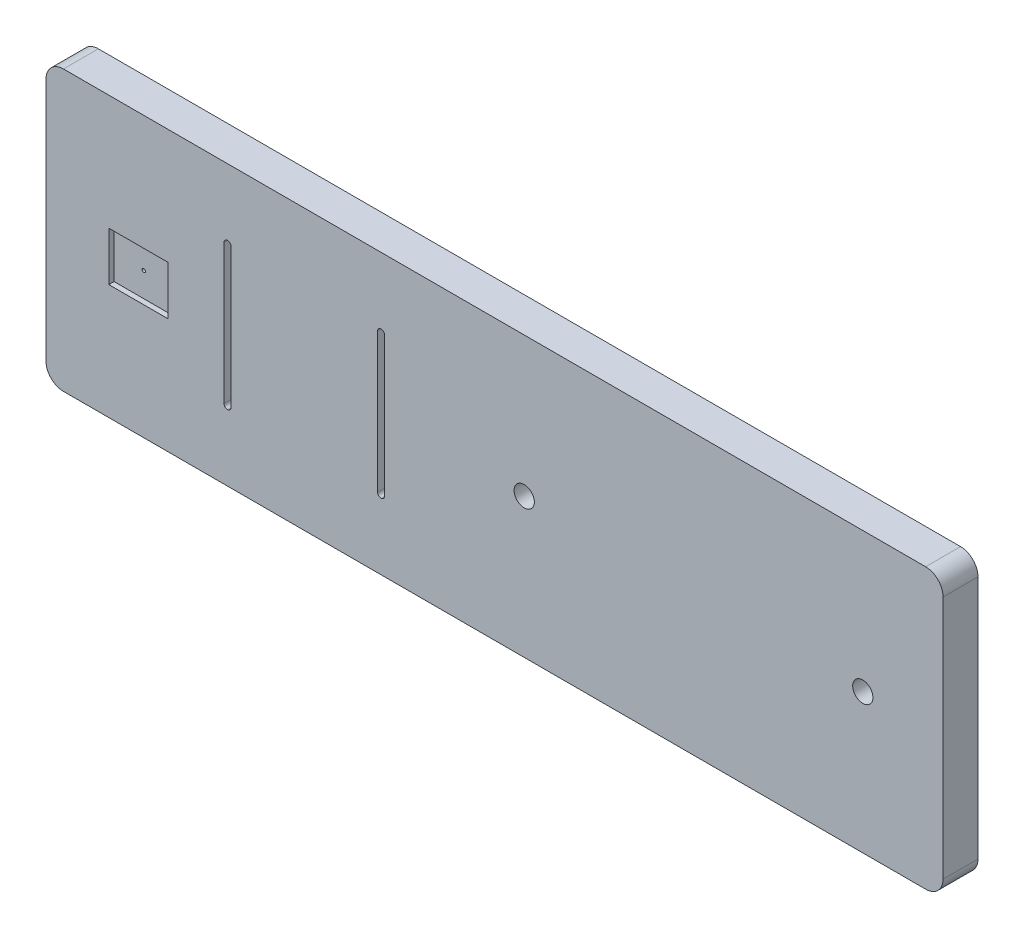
ISO-10303-21;
HEADER;
FILE_DESCRIPTION(('STEP AP214'),'2;1');
FILE_NAME('part.step','',(''),(''),'','','');
FILE_SCHEMA(('AUTOMOTIVE_DESIGN { 1 0 10303 214 1 1 1 1 }'));
ENDSEC;
DATA;
#1=APPLICATION_CONTEXT('core data for automotive mechanical design processes');
#2=APPLICATION_PROTOCOL_DEFINITION('international standard','automotive_design',2000,#1);
#3=PRODUCT_CONTEXT('',#1,'mechanical');
#4=PRODUCT('Part','Part','',(#3));
#5=PRODUCT_RELATED_PRODUCT_CATEGORY('part','',(#4));
#6=PRODUCT_DEFINITION_FORMATION('','',#4);
#7=PRODUCT_DEFINITION_CONTEXT('part definition',#1,'design');
#8=PRODUCT_DEFINITION('design','',#6,#7);
#9=PRODUCT_DEFINITION_SHAPE('','',#8);
#10=(LENGTH_UNIT() NAMED_UNIT(*) SI_UNIT(.MILLI.,.METRE.));
#11=(NAMED_UNIT(*) PLANE_ANGLE_UNIT() SI_UNIT($,.RADIAN.));
#12=(NAMED_UNIT(*) SI_UNIT($,.STERADIAN.) SOLID_ANGLE_UNIT());
#13=UNCERTAINTY_MEASURE_WITH_UNIT(LENGTH_MEASURE(1.E-05),#10,'distance_accuracy_value','');
#14=(GEOMETRIC_REPRESENTATION_CONTEXT(3) GLOBAL_UNCERTAINTY_ASSIGNED_CONTEXT((#13)) GLOBAL_UNIT_ASSIGNED_CONTEXT((#10,
#11,#12)) REPRESENTATION_CONTEXT('',''));
#15=CARTESIAN_POINT('',(0.,0.,0.));
#16=DIRECTION('',(0.,0.,1.));
#17=DIRECTION('',(1.,0.,0.));
#18=AXIS2_PLACEMENT_3D('',#15,#16,#17);
#19=CARTESIAN_POINT('',(-132.,35.,10.));
#20=DIRECTION('',(0.,0.,1.));
#21=DIRECTION('',(1.,0.,0.));
#22=AXIS2_PLACEMENT_3D('',#19,#20,#21);
#23=PLANE('',#22);
#24=DIRECTION('',(0.,-1.,0.));
#25=VECTOR('',#24,1.);
#26=CARTESIAN_POINT('',(-119.,7.,10.));
#27=LINE('',#26,#25);
#28=CARTESIAN_POINT('',(-119.,7.,10.));
#29=VERTEX_POINT('',#28);
#30=CARTESIAN_POINT('',(-119.,-7.,10.));
#31=VERTEX_POINT('',#30);
#32=EDGE_CURVE('E41',#29,#31,#27,.T.);
#33=ORIENTED_EDGE('',*,*,#32,.F.);
#34=DIRECTION('',(-1.,0.,0.));
#35=VECTOR('',#34,1.);
#36=CARTESIAN_POINT('',(-119.,7.,10.));
#37=LINE('',#36,#35);
#38=CARTESIAN_POINT('',(-102.,7.,10.));
#39=VERTEX_POINT('',#38);
#40=EDGE_CURVE('E232',#39,#29,#37,.T.);
#41=ORIENTED_EDGE('',*,*,#40,.F.);
#42=DIRECTION('',(0.,1.,0.));
#43=VECTOR('',#42,1.);
#44=CARTESIAN_POINT('',(-102.,7.,10.));
#45=LINE('',#44,#43);
#46=CARTESIAN_POINT('',(-102.,-7.,10.));
#47=VERTEX_POINT('',#46);
#48=EDGE_CURVE('E215',#47,#39,#45,.T.);
#49=ORIENTED_EDGE('',*,*,#48,.F.);
#50=DIRECTION('',(1.,0.,0.));
#51=VECTOR('',#50,1.);
#52=CARTESIAN_POINT('',(-119.,-7.,10.));
#53=LINE('',#52,#51);
#54=EDGE_CURVE('E226',#31,#47,#53,.T.);
#55=ORIENTED_EDGE('',*,*,#54,.F.);
#56=EDGE_LOOP('',(#33,#41,#49,#55));
#57=FACE_BOUND('',#56,.T.);
#58=CARTESIAN_POINT('',(-41.01,20.,10.));
#59=DIRECTION('',(0.,0.,1.));
#60=DIRECTION('',(1.,0.,0.));
#61=AXIS2_PLACEMENT_3D('',#58,#59,#60);
#62=CIRCLE('',#61,0.989999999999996);
#63=CARTESIAN_POINT('',(-41.01,20.99,10.));
#64=VERTEX_POINT('',#63);
#65=CARTESIAN_POINT('',(-42.,20.,10.));
#66=VERTEX_POINT('',#65);
#67=EDGE_CURVE('E49',#64,#66,#62,.T.);
#68=ORIENTED_EDGE('',*,*,#67,.F.);
#69=DIRECTION('',(-1.,0.,0.));
#70=VECTOR('',#69,1.);
#71=CARTESIAN_POINT('',(-41.01,20.99,10.));
#72=LINE('',#71,#70);
#73=CARTESIAN_POINT('',(-40.99,20.99,10.));
#74=VERTEX_POINT('',#73);
#75=EDGE_CURVE('E269',#74,#64,#72,.T.);
#76=ORIENTED_EDGE('',*,*,#75,.F.);
#77=CARTESIAN_POINT('',(-40.99,20.,10.));
#78=DIRECTION('',(0.,0.,1.));
#79=DIRECTION('',(-1.,0.,0.));
#80=AXIS2_PLACEMENT_3D('',#77,#78,#79);
#81=CIRCLE('',#80,0.99);
#82=CARTESIAN_POINT('',(-40.,20.,10.));
#83=VERTEX_POINT('',#82);
#84=EDGE_CURVE('E266',#83,#74,#81,.T.);
#85=ORIENTED_EDGE('',*,*,#84,.F.);
#86=DIRECTION('',(0.,1.,0.));
#87=VECTOR('',#86,1.);
#88=CARTESIAN_POINT('',(-40.,20.,10.));
#89=LINE('',#88,#87);
#90=CARTESIAN_POINT('',(-40.,-20.,10.));
#91=VERTEX_POINT('',#90);
#92=EDGE_CURVE('E263',#91,#83,#89,.T.);
#93=ORIENTED_EDGE('',*,*,#92,.F.);
#94=CARTESIAN_POINT('',(-40.99,-20.,10.));
#95=DIRECTION('',(0.,0.,1.));
#96=DIRECTION('',(1.,0.,0.));
#97=AXIS2_PLACEMENT_3D('',#94,#95,#96);
#98=CIRCLE('',#97,0.99);
#99=CARTESIAN_POINT('',(-40.99,-20.99,10.));
#100=VERTEX_POINT('',#99);
#101=EDGE_CURVE('E260',#100,#91,#98,.T.);
#102=ORIENTED_EDGE('',*,*,#101,.F.);
#103=DIRECTION('',(1.,1.73472347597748E-13,0.));
#104=VECTOR('',#103,1.);
#105=CARTESIAN_POINT('',(-41.01,-20.99,10.));
#106=LINE('',#105,#104);
#107=CARTESIAN_POINT('',(-41.01,-20.99,10.));
#108=VERTEX_POINT('',#107);
#109=EDGE_CURVE('E257',#108,#100,#106,.T.);
#110=ORIENTED_EDGE('',*,*,#109,.F.);
#111=CARTESIAN_POINT('',(-41.01,-20.,10.));
#112=DIRECTION('',(0.,0.,1.));
#113=DIRECTION('',(1.,0.,0.));
#114=AXIS2_PLACEMENT_3D('',#111,#112,#113);
#115=CIRCLE('',#114,0.989999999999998);
#116=CARTESIAN_POINT('',(-42.,-20.,10.));
#117=VERTEX_POINT('',#116);
#118=EDGE_CURVE('E254',#117,#108,#115,.T.);
#119=ORIENTED_EDGE('',*,*,#118,.F.);
#120=DIRECTION('',(0.,-1.,0.));
#121=VECTOR('',#120,1.);
#122=CARTESIAN_POINT('',(-42.,20.,10.));
#123=LINE('',#122,#121);
#124=EDGE_CURVE('E251',#66,#117,#123,.T.);
#125=ORIENTED_EDGE('',*,*,#124,.F.);
#126=EDGE_LOOP('',(#68,#76,#85,#93,#102,#110,#119,#125));
#127=FACE_BOUND('',#126,.T.);
#128=CARTESIAN_POINT('',(-85.01,20.,10.));
#129=DIRECTION('',(0.,0.,1.));
#130=DIRECTION('',(1.,0.,0.));
#131=AXIS2_PLACEMENT_3D('',#128,#129,#130);
#132=CIRCLE('',#131,0.990000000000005);
#133=CARTESIAN_POINT('',(-85.01,20.99,10.));
#134=VERTEX_POINT('',#133);
#135=CARTESIAN_POINT('',(-86.,20.,10.));
#136=VERTEX_POINT('',#135);
#137=EDGE_CURVE('E299',#134,#136,#132,.T.);
#138=ORIENTED_EDGE('',*,*,#137,.F.);
#139=DIRECTION('',(-1.,-1.73472347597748E-13,0.));
#140=VECTOR('',#139,1.);
#141=CARTESIAN_POINT('',(-85.01,20.99,10.));
#142=LINE('',#141,#140);
#143=CARTESIAN_POINT('',(-84.99,20.99,10.));
#144=VERTEX_POINT('',#143);
#145=EDGE_CURVE('E332',#144,#134,#142,.T.);
#146=ORIENTED_EDGE('',*,*,#145,.F.);
#147=CARTESIAN_POINT('',(-84.99,20.,10.));
#148=DIRECTION('',(0.,0.,1.));
#149=DIRECTION('',(-1.,0.,0.));
#150=AXIS2_PLACEMENT_3D('',#147,#148,#149);
#151=CIRCLE('',#150,0.990000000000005);
#152=CARTESIAN_POINT('',(-84.,20.,10.));
#153=VERTEX_POINT('',#152);
#154=EDGE_CURVE('E329',#153,#144,#151,.T.);
#155=ORIENTED_EDGE('',*,*,#154,.F.);
#156=DIRECTION('',(0.,1.,0.));
#157=VECTOR('',#156,1.);
#158=CARTESIAN_POINT('',(-84.,20.,10.));
#159=LINE('',#158,#157);
#160=CARTESIAN_POINT('',(-84.,-20.,10.));
#161=VERTEX_POINT('',#160);
#162=EDGE_CURVE('E326',#161,#153,#159,.T.);
#163=ORIENTED_EDGE('',*,*,#162,.F.);
#164=CARTESIAN_POINT('',(-84.99,-20.,10.));
#165=DIRECTION('',(0.,0.,1.));
#166=DIRECTION('',(1.,0.,0.));
#167=AXIS2_PLACEMENT_3D('',#164,#165,#166);
#168=CIRCLE('',#167,0.990000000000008);
#169=CARTESIAN_POINT('',(-84.99,-20.99,10.));
#170=VERTEX_POINT('',#169);
#171=EDGE_CURVE('E323',#170,#161,#168,.T.);
#172=ORIENTED_EDGE('',*,*,#171,.F.);
#173=DIRECTION('',(1.,1.73472347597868E-13,0.));
#174=VECTOR('',#173,1.);
#175=CARTESIAN_POINT('',(-85.01,-20.99,10.));
#176=LINE('',#175,#174);
#177=CARTESIAN_POINT('',(-85.01,-20.99,10.));
#178=VERTEX_POINT('',#177);
#179=EDGE_CURVE('E320',#178,#170,#176,.T.);
#180=ORIENTED_EDGE('',*,*,#179,.F.);
#181=CARTESIAN_POINT('',(-85.01,-20.,10.));
#182=DIRECTION('',(0.,0.,1.));
#183=DIRECTION('',(1.,0.,0.));
#184=AXIS2_PLACEMENT_3D('',#181,#182,#183);
#185=CIRCLE('',#184,0.990000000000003);
#186=CARTESIAN_POINT('',(-86.,-20.,10.));
#187=VERTEX_POINT('',#186);
#188=EDGE_CURVE('E317',#187,#178,#185,.T.);
#189=ORIENTED_EDGE('',*,*,#188,.F.);
#190=DIRECTION('',(0.,-1.,0.));
#191=VECTOR('',#190,1.);
#192=CARTESIAN_POINT('',(-86.,20.,10.));
#193=LINE('',#192,#191);
#194=EDGE_CURVE('E314',#136,#187,#193,.T.);
#195=ORIENTED_EDGE('',*,*,#194,.F.);
#196=EDGE_LOOP('',(#138,#146,#155,#163,#172,#180,#189,#195));
#197=FACE_BOUND('',#196,.T.);
#198=CARTESIAN_POINT('',(97.,0.,10.));
#199=DIRECTION('',(0.,0.,1.));
#200=DIRECTION('',(1.,0.,0.));
#201=AXIS2_PLACEMENT_3D('',#198,#199,#200);
#202=CIRCLE('',#201,2.9);
#203=CARTESIAN_POINT('',(99.9,0.,10.));
#204=VERTEX_POINT('',#203);
#205=EDGE_CURVE('E385',#204,#204,#202,.T.);
#206=ORIENTED_EDGE('',*,*,#205,.F.);
#207=EDGE_LOOP('',(#206));
#208=FACE_BOUND('',#207,.T.);
#209=CARTESIAN_POINT('',(-132.,35.,10.));
#210=DIRECTION('',(0.,0.,1.));
#211=DIRECTION('',(1.,0.,0.));
#212=AXIS2_PLACEMENT_3D('',#209,#210,#211);
#213=CIRCLE('',#212,5.);
#214=CARTESIAN_POINT('',(-132.,40.,10.));
#215=VERTEX_POINT('',#214);
#216=CARTESIAN_POINT('',(-137.,35.,10.));
#217=VERTEX_POINT('',#216);
#218=EDGE_CURVE('E405',#215,#217,#213,.T.);
#219=ORIENTED_EDGE('',*,*,#218,.T.);
#220=DIRECTION('',(0.,-1.,0.));
#221=VECTOR('',#220,1.);
#222=CARTESIAN_POINT('',(-137.,35.,10.));
#223=LINE('',#222,#221);
#224=CARTESIAN_POINT('',(-137.,-35.,10.));
#225=VERTEX_POINT('',#224);
#226=EDGE_CURVE('E408',#217,#225,#223,.T.);
#227=ORIENTED_EDGE('',*,*,#226,.T.);
#228=CARTESIAN_POINT('',(-132.,-35.,10.));
#229=DIRECTION('',(0.,0.,1.));
#230=DIRECTION('',(-1.,0.,0.));
#231=AXIS2_PLACEMENT_3D('',#228,#229,#230);
#232=CIRCLE('',#231,5.);
#233=CARTESIAN_POINT('',(-132.,-40.,10.));
#234=VERTEX_POINT('',#233);
#235=EDGE_CURVE('E410',#225,#234,#232,.T.);
#236=ORIENTED_EDGE('',*,*,#235,.T.);
#237=DIRECTION('',(1.,0.,0.));
#238=VECTOR('',#237,1.);
#239=CARTESIAN_POINT('',(115.,-40.,10.));
#240=LINE('',#239,#238);
#241=CARTESIAN_POINT('',(115.,-40.,10.));
#242=VERTEX_POINT('',#241);
#243=EDGE_CURVE('E412',#234,#242,#240,.T.);
#244=ORIENTED_EDGE('',*,*,#243,.T.);
#245=CARTESIAN_POINT('',(115.,-35.,10.));
#246=DIRECTION('',(0.,0.,1.));
#247=DIRECTION('',(-1.,0.,0.));
#248=AXIS2_PLACEMENT_3D('',#245,#246,#247);
#249=CIRCLE('',#248,5.00000000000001);
#250=CARTESIAN_POINT('',(120.,-35.,10.));
#251=VERTEX_POINT('',#250);
#252=EDGE_CURVE('E414',#242,#251,#249,.T.);
#253=ORIENTED_EDGE('',*,*,#252,.T.);
#254=DIRECTION('',(0.,1.,0.));
#255=VECTOR('',#254,1.);
#256=CARTESIAN_POINT('',(120.,35.,10.));
#257=LINE('',#256,#255);
#258=CARTESIAN_POINT('',(120.,35.,10.));
#259=VERTEX_POINT('',#258);
#260=EDGE_CURVE('E416',#251,#259,#257,.T.);
#261=ORIENTED_EDGE('',*,*,#260,.T.);
#262=CARTESIAN_POINT('',(115.,35.,10.));
#263=DIRECTION('',(0.,0.,1.));
#264=DIRECTION('',(-1.,0.,0.));
#265=AXIS2_PLACEMENT_3D('',#262,#263,#264);
#266=CIRCLE('',#265,5.);
#267=CARTESIAN_POINT('',(115.,40.,10.));
#268=VERTEX_POINT('',#267);
#269=EDGE_CURVE('E418',#259,#268,#266,.T.);
#270=ORIENTED_EDGE('',*,*,#269,.T.);
#271=DIRECTION('',(-1.,0.,0.));
#272=VECTOR('',#271,1.);
#273=CARTESIAN_POINT('',(115.,40.,10.));
#274=LINE('',#273,#272);
#275=EDGE_CURVE('E420',#268,#215,#274,.T.);
#276=ORIENTED_EDGE('',*,*,#275,.T.);
#277=EDGE_LOOP('',(#219,#227,#236,#244,#253,#261,#270,#276));
#278=FACE_BOUND('',#277,.T.);
#279=CARTESIAN_POINT('',(0.,0.,10.));
#280=DIRECTION('',(0.,0.,1.));
#281=DIRECTION('',(1.,0.,0.));
#282=AXIS2_PLACEMENT_3D('',#279,#280,#281);
#283=CIRCLE('',#282,2.9);
#284=CARTESIAN_POINT('',(2.9,0.,10.));
#285=VERTEX_POINT('',#284);
#286=EDGE_CURVE('E379',#285,#285,#283,.T.);
#287=ORIENTED_EDGE('',*,*,#286,.F.);
#288=EDGE_LOOP('',(#287));
#289=FACE_BOUND('',#288,.T.);
#290=ADVANCED_FACE('F26',(#57,#127,#197,#208,#278,#289),#23,.T.);
#291=CARTESIAN_POINT('',(-132.,35.,0.));
#292=DIRECTION('',(0.,0.,1.));
#293=DIRECTION('',(1.,0.,0.));
#294=AXIS2_PLACEMENT_3D('',#291,#292,#293);
#295=PLANE('',#294);
#296=CARTESIAN_POINT('',(97.,0.,0.));
#297=DIRECTION('',(0.,0.,1.));
#298=DIRECTION('',(1.,0.,0.));
#299=AXIS2_PLACEMENT_3D('',#296,#297,#298);
#300=CIRCLE('',#299,2.9);
#301=CARTESIAN_POINT('',(99.9,0.,0.));
#302=VERTEX_POINT('',#301);
#303=EDGE_CURVE('E382',#302,#302,#300,.T.);
#304=ORIENTED_EDGE('',*,*,#303,.T.);
#305=EDGE_LOOP('',(#304));
#306=FACE_BOUND('',#305,.T.);
#307=CARTESIAN_POINT('',(-132.,35.,0.));
#308=DIRECTION('',(0.,0.,1.));
#309=DIRECTION('',(1.,0.,0.));
#310=AXIS2_PLACEMENT_3D('',#307,#308,#309);
#311=CIRCLE('',#310,5.);
#312=CARTESIAN_POINT('',(-132.,40.,0.));
#313=VERTEX_POINT('',#312);
#314=CARTESIAN_POINT('',(-137.,35.,0.));
#315=VERTEX_POINT('',#314);
#316=EDGE_CURVE('E388',#313,#315,#311,.T.);
#317=ORIENTED_EDGE('',*,*,#316,.F.);
#318=DIRECTION('',(-1.,0.,0.));
#319=VECTOR('',#318,1.);
#320=CARTESIAN_POINT('',(115.,40.,0.));
#321=LINE('',#320,#319);
#322=CARTESIAN_POINT('',(115.,40.,0.));
#323=VERTEX_POINT('',#322);
#324=EDGE_CURVE('E403',#323,#313,#321,.T.);
#325=ORIENTED_EDGE('',*,*,#324,.F.);
#326=CARTESIAN_POINT('',(115.,35.,0.));
#327=DIRECTION('',(0.,0.,1.));
#328=DIRECTION('',(-1.,0.,0.));
#329=AXIS2_PLACEMENT_3D('',#326,#327,#328);
#330=CIRCLE('',#329,5.);
#331=CARTESIAN_POINT('',(120.,35.,0.));
#332=VERTEX_POINT('',#331);
#333=EDGE_CURVE('E401',#332,#323,#330,.T.);
#334=ORIENTED_EDGE('',*,*,#333,.F.);
#335=DIRECTION('',(0.,1.,0.));
#336=VECTOR('',#335,1.);
#337=CARTESIAN_POINT('',(120.,35.,0.));
#338=LINE('',#337,#336);
#339=CARTESIAN_POINT('',(120.,-35.,0.));
#340=VERTEX_POINT('',#339);
#341=EDGE_CURVE('E399',#340,#332,#338,.T.);
#342=ORIENTED_EDGE('',*,*,#341,.F.);
#343=CARTESIAN_POINT('',(115.,-35.,0.));
#344=DIRECTION('',(0.,0.,1.));
#345=DIRECTION('',(-1.,0.,0.));
#346=AXIS2_PLACEMENT_3D('',#343,#344,#345);
#347=CIRCLE('',#346,5.00000000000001);
#348=CARTESIAN_POINT('',(115.,-40.,0.));
#349=VERTEX_POINT('',#348);
#350=EDGE_CURVE('E397',#349,#340,#347,.T.);
#351=ORIENTED_EDGE('',*,*,#350,.F.);
#352=DIRECTION('',(1.,0.,0.));
#353=VECTOR('',#352,1.);
#354=CARTESIAN_POINT('',(115.,-40.,0.));
#355=LINE('',#354,#353);
#356=CARTESIAN_POINT('',(-132.,-40.,0.));
#357=VERTEX_POINT('',#356);
#358=EDGE_CURVE('E395',#357,#349,#355,.T.);
#359=ORIENTED_EDGE('',*,*,#358,.F.);
#360=CARTESIAN_POINT('',(-132.,-35.,0.));
#361=DIRECTION('',(0.,0.,1.));
#362=DIRECTION('',(-1.,0.,0.));
#363=AXIS2_PLACEMENT_3D('',#360,#361,#362);
#364=CIRCLE('',#363,5.);
#365=CARTESIAN_POINT('',(-137.,-35.,0.));
#366=VERTEX_POINT('',#365);
#367=EDGE_CURVE('E393',#366,#357,#364,.T.);
#368=ORIENTED_EDGE('',*,*,#367,.F.);
#369=DIRECTION('',(0.,-1.,0.));
#370=VECTOR('',#369,1.);
#371=CARTESIAN_POINT('',(-137.,35.,0.));
#372=LINE('',#371,#370);
#373=EDGE_CURVE('E391',#315,#366,#372,.T.);
#374=ORIENTED_EDGE('',*,*,#373,.F.);
#375=EDGE_LOOP('',(#317,#325,#334,#342,#351,#359,#368,#374));
#376=FACE_BOUND('',#375,.T.);
#377=CARTESIAN_POINT('',(0.,0.,0.));
#378=DIRECTION('',(0.,0.,1.));
#379=DIRECTION('',(1.,0.,0.));
#380=AXIS2_PLACEMENT_3D('',#377,#378,#379);
#381=CIRCLE('',#380,2.9);
#382=CARTESIAN_POINT('',(2.9,0.,0.));
#383=VERTEX_POINT('',#382);
#384=EDGE_CURVE('E362',#383,#383,#381,.T.);
#385=ORIENTED_EDGE('',*,*,#384,.T.);
#386=EDGE_LOOP('',(#385));
#387=FACE_BOUND('',#386,.T.);
#388=ADVANCED_FACE('F450',(#306,#376,#387),#295,.F.);
#389=CARTESIAN_POINT('',(-132.,35.,10.));
#390=DIRECTION('',(0.,0.,-1.));
#391=DIRECTION('',(-1.,0.,0.));
#392=AXIS2_PLACEMENT_3D('',#389,#390,#391);
#393=CYLINDRICAL_SURFACE('',#392,5.);
#394=ORIENTED_EDGE('',*,*,#316,.T.);
#395=DIRECTION('',(0.,0.,-1.));
#396=VECTOR('',#395,1.);
#397=CARTESIAN_POINT('',(-137.,35.,10.));
#398=LINE('',#397,#396);
#399=EDGE_CURVE('E11',#217,#315,#398,.T.);
#400=ORIENTED_EDGE('',*,*,#399,.F.);
#401=ORIENTED_EDGE('',*,*,#218,.F.);
#402=DIRECTION('',(0.,0.,-1.));
#403=VECTOR('',#402,1.);
#404=CARTESIAN_POINT('',(-132.,40.,10.));
#405=LINE('',#404,#403);
#406=EDGE_CURVE('E422',#215,#313,#405,.T.);
#407=ORIENTED_EDGE('',*,*,#406,.T.);
#408=EDGE_LOOP('',(#394,#400,#401,#407));
#409=FACE_BOUND('',#408,.T.);
#410=ADVANCED_FACE('F28',(#409),#393,.T.);
#411=CARTESIAN_POINT('',(-137.,35.,10.));
#412=DIRECTION('',(1.,0.,0.));
#413=DIRECTION('',(0.,0.,-1.));
#414=AXIS2_PLACEMENT_3D('',#411,#412,#413);
#415=PLANE('',#414);
#416=ORIENTED_EDGE('',*,*,#373,.T.);
#417=DIRECTION('',(0.,0.,-1.));
#418=VECTOR('',#417,1.);
#419=CARTESIAN_POINT('',(-137.,-35.,10.));
#420=LINE('',#419,#418);
#421=EDGE_CURVE('E34',#225,#366,#420,.T.);
#422=ORIENTED_EDGE('',*,*,#421,.F.);
#423=ORIENTED_EDGE('',*,*,#226,.F.);
#424=ORIENTED_EDGE('',*,*,#399,.T.);
#425=EDGE_LOOP('',(#416,#422,#423,#424));
#426=FACE_BOUND('',#425,.T.);
#427=ADVANCED_FACE('F468',(#426),#415,.F.);
#428=CARTESIAN_POINT('',(-132.,-35.,10.));
#429=DIRECTION('',(0.,0.,-1.));
#430=DIRECTION('',(-1.,0.,0.));
#431=AXIS2_PLACEMENT_3D('',#428,#429,#430);
#432=CYLINDRICAL_SURFACE('',#431,5.);
#433=ORIENTED_EDGE('',*,*,#367,.T.);
#434=DIRECTION('',(0.,0.,-1.));
#435=VECTOR('',#434,1.);
#436=CARTESIAN_POINT('',(-132.,-40.,10.));
#437=LINE('',#436,#435);
#438=EDGE_CURVE('E437',#234,#357,#437,.T.);
#439=ORIENTED_EDGE('',*,*,#438,.F.);
#440=ORIENTED_EDGE('',*,*,#235,.F.);
#441=ORIENTED_EDGE('',*,*,#421,.T.);
#442=EDGE_LOOP('',(#433,#439,#440,#441));
#443=FACE_BOUND('',#442,.T.);
#444=ADVANCED_FACE('F444',(#443),#432,.T.);
#445=CARTESIAN_POINT('',(115.,-40.,10.));
#446=DIRECTION('',(0.,1.,0.));
#447=DIRECTION('',(-1.,0.,0.));
#448=AXIS2_PLACEMENT_3D('',#445,#446,#447);
#449=PLANE('',#448);
#450=ORIENTED_EDGE('',*,*,#358,.T.);
#451=DIRECTION('',(0.,0.,-1.));
#452=VECTOR('',#451,1.);
#453=CARTESIAN_POINT('',(115.,-40.,10.));
#454=LINE('',#453,#452);
#455=EDGE_CURVE('E434',#242,#349,#454,.T.);
#456=ORIENTED_EDGE('',*,*,#455,.F.);
#457=ORIENTED_EDGE('',*,*,#243,.F.);
#458=ORIENTED_EDGE('',*,*,#438,.T.);
#459=EDGE_LOOP('',(#450,#456,#457,#458));
#460=FACE_BOUND('',#459,.T.);
#461=ADVANCED_FACE('F456',(#460),#449,.F.);
#462=CARTESIAN_POINT('',(115.,-35.,10.));
#463=DIRECTION('',(0.,0.,-1.));
#464=DIRECTION('',(-1.,0.,0.));
#465=AXIS2_PLACEMENT_3D('',#462,#463,#464);
#466=CYLINDRICAL_SURFACE('',#465,5.00000000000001);
#467=ORIENTED_EDGE('',*,*,#350,.T.);
#468=DIRECTION('',(0.,0.,-1.));
#469=VECTOR('',#468,1.);
#470=CARTESIAN_POINT('',(120.,-35.,10.));
#471=LINE('',#470,#469);
#472=EDGE_CURVE('E431',#251,#340,#471,.T.);
#473=ORIENTED_EDGE('',*,*,#472,.F.);
#474=ORIENTED_EDGE('',*,*,#252,.F.);
#475=ORIENTED_EDGE('',*,*,#455,.T.);
#476=EDGE_LOOP('',(#467,#473,#474,#475));
#477=FACE_BOUND('',#476,.T.);
#478=ADVANCED_FACE('F460',(#477),#466,.T.);
#479=CARTESIAN_POINT('',(120.,35.,10.));
#480=DIRECTION('',(-1.,0.,0.));
#481=DIRECTION('',(0.,-1.,0.));
#482=AXIS2_PLACEMENT_3D('',#479,#480,#481);
#483=PLANE('',#482);
#484=ORIENTED_EDGE('',*,*,#341,.T.);
#485=DIRECTION('',(0.,0.,-1.));
#486=VECTOR('',#485,1.);
#487=CARTESIAN_POINT('',(120.,35.,10.));
#488=LINE('',#487,#486);
#489=EDGE_CURVE('E428',#259,#332,#488,.T.);
#490=ORIENTED_EDGE('',*,*,#489,.F.);
#491=ORIENTED_EDGE('',*,*,#260,.F.);
#492=ORIENTED_EDGE('',*,*,#472,.T.);
#493=EDGE_LOOP('',(#484,#490,#491,#492));
#494=FACE_BOUND('',#493,.T.);
#495=ADVANCED_FACE('F481',(#494),#483,.F.);
#496=CARTESIAN_POINT('',(115.,35.,10.));
#497=DIRECTION('',(0.,0.,-1.));
#498=DIRECTION('',(-1.,0.,0.));
#499=AXIS2_PLACEMENT_3D('',#496,#497,#498);
#500=CYLINDRICAL_SURFACE('',#499,5.);
#501=ORIENTED_EDGE('',*,*,#333,.T.);
#502=DIRECTION('',(0.,0.,-1.));
#503=VECTOR('',#502,1.);
#504=CARTESIAN_POINT('',(115.,40.,10.));
#505=LINE('',#504,#503);
#506=EDGE_CURVE('E425',#268,#323,#505,.T.);
#507=ORIENTED_EDGE('',*,*,#506,.F.);
#508=ORIENTED_EDGE('',*,*,#269,.F.);
#509=ORIENTED_EDGE('',*,*,#489,.T.);
#510=EDGE_LOOP('',(#501,#507,#508,#509));
#511=FACE_BOUND('',#510,.T.);
#512=ADVANCED_FACE('F479',(#511),#500,.T.);
#513=CARTESIAN_POINT('',(115.,40.,10.));
#514=DIRECTION('',(0.,-1.,0.));
#515=DIRECTION('',(1.,0.,0.));
#516=AXIS2_PLACEMENT_3D('',#513,#514,#515);
#517=PLANE('',#516);
#518=ORIENTED_EDGE('',*,*,#324,.T.);
#519=ORIENTED_EDGE('',*,*,#406,.F.);
#520=ORIENTED_EDGE('',*,*,#275,.F.);
#521=ORIENTED_EDGE('',*,*,#506,.T.);
#522=EDGE_LOOP('',(#518,#519,#520,#521));
#523=FACE_BOUND('',#522,.T.);
#524=ADVANCED_FACE('F474',(#523),#517,.F.);
#525=CARTESIAN_POINT('',(97.,0.,10.));
#526=DIRECTION('',(0.,0.,-1.));
#527=DIRECTION('',(-1.,0.,0.));
#528=AXIS2_PLACEMENT_3D('',#525,#526,#527);
#529=CYLINDRICAL_SURFACE('',#528,2.9);
#530=ORIENTED_EDGE('',*,*,#205,.T.);
#531=EDGE_LOOP('',(#530));
#532=FACE_BOUND('',#531,.T.);
#533=ORIENTED_EDGE('',*,*,#303,.F.);
#534=EDGE_LOOP('',(#533));
#535=FACE_BOUND('',#534,.T.);
#536=ADVANCED_FACE('F502',(#532,#535),#529,.F.);
#537=CARTESIAN_POINT('',(0.,0.,10.));
#538=DIRECTION('',(0.,0.,-1.));
#539=DIRECTION('',(-1.,0.,0.));
#540=AXIS2_PLACEMENT_3D('',#537,#538,#539);
#541=CYLINDRICAL_SURFACE('',#540,2.9);
#542=ORIENTED_EDGE('',*,*,#286,.T.);
#543=EDGE_LOOP('',(#542));
#544=FACE_BOUND('',#543,.T.);
#545=ORIENTED_EDGE('',*,*,#384,.F.);
#546=EDGE_LOOP('',(#545));
#547=FACE_BOUND('',#546,.T.);
#548=ADVANCED_FACE('F506',(#544,#547),#541,.F.);
#549=CARTESIAN_POINT('',(-85.01,20.,5.));
#550=DIRECTION('',(0.,0.,1.));
#551=DIRECTION('',(1.,0.,0.));
#552=AXIS2_PLACEMENT_3D('',#549,#550,#551);
#553=CYLINDRICAL_SURFACE('',#552,0.990000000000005);
#554=ORIENTED_EDGE('',*,*,#137,.T.);
#555=DIRECTION('',(0.,0.,1.));
#556=VECTOR('',#555,1.);
#557=CARTESIAN_POINT('',(-86.,20.,5.));
#558=LINE('',#557,#556);
#559=CARTESIAN_POINT('',(-86.,20.,5.));
#560=VERTEX_POINT('',#559);
#561=EDGE_CURVE('E359',#560,#136,#558,.T.);
#562=ORIENTED_EDGE('',*,*,#561,.F.);
#563=CARTESIAN_POINT('',(-85.01,20.,5.));
#564=DIRECTION('',(0.,0.,1.));
#565=DIRECTION('',(1.,0.,0.));
#566=AXIS2_PLACEMENT_3D('',#563,#564,#565);
#567=CIRCLE('',#566,0.990000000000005);
#568=CARTESIAN_POINT('',(-85.01,20.99,5.));
#569=VERTEX_POINT('',#568);
#570=EDGE_CURVE('E335',#569,#560,#567,.T.);
#571=ORIENTED_EDGE('',*,*,#570,.F.);
#572=DIRECTION('',(0.,0.,1.));
#573=VECTOR('',#572,1.);
#574=CARTESIAN_POINT('',(-85.01,20.99,5.));
#575=LINE('',#574,#573);
#576=EDGE_CURVE('E360',#569,#134,#575,.T.);
#577=ORIENTED_EDGE('',*,*,#576,.T.);
#578=EDGE_LOOP('',(#554,#562,#571,#577));
#579=FACE_BOUND('',#578,.T.);
#580=ADVANCED_FACE('F511',(#579),#553,.F.);
#581=CARTESIAN_POINT('',(-85.01,20.99,5.));
#582=DIRECTION('',(-1.73472347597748E-13,1.,0.));
#583=DIRECTION('',(-1.,-1.73472347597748E-13,0.));
#584=AXIS2_PLACEMENT_3D('',#581,#582,#583);
#585=PLANE('',#584);
#586=ORIENTED_EDGE('',*,*,#145,.T.);
#587=ORIENTED_EDGE('',*,*,#576,.F.);
#588=DIRECTION('',(-1.,-1.73472347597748E-13,0.));
#589=VECTOR('',#588,1.);
#590=CARTESIAN_POINT('',(-85.01,20.99,5.));
#591=LINE('',#590,#589);
#592=CARTESIAN_POINT('',(-84.99,20.99,5.));
#593=VERTEX_POINT('',#592);
#594=EDGE_CURVE('E356',#593,#569,#591,.T.);
#595=ORIENTED_EDGE('',*,*,#594,.F.);
#596=DIRECTION('',(0.,0.,1.));
#597=VECTOR('',#596,1.);
#598=CARTESIAN_POINT('',(-84.99,20.99,5.));
#599=LINE('',#598,#597);
#600=EDGE_CURVE('E363',#593,#144,#599,.T.);
#601=ORIENTED_EDGE('',*,*,#600,.T.);
#602=EDGE_LOOP('',(#586,#587,#595,#601));
#603=FACE_BOUND('',#602,.T.);
#604=ADVANCED_FACE('F518',(#603),#585,.F.);
#605=CARTESIAN_POINT('',(-84.99,20.,5.));
#606=DIRECTION('',(0.,0.,1.));
#607=DIRECTION('',(1.,0.,0.));
#608=AXIS2_PLACEMENT_3D('',#605,#606,#607);
#609=CYLINDRICAL_SURFACE('',#608,0.990000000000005);
#610=ORIENTED_EDGE('',*,*,#154,.T.);
#611=ORIENTED_EDGE('',*,*,#600,.F.);
#612=CARTESIAN_POINT('',(-84.99,20.,5.));
#613=DIRECTION('',(0.,0.,1.));
#614=DIRECTION('',(-1.,0.,0.));
#615=AXIS2_PLACEMENT_3D('',#612,#613,#614);
#616=CIRCLE('',#615,0.990000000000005);
#617=CARTESIAN_POINT('',(-84.,20.,5.));
#618=VERTEX_POINT('',#617);
#619=EDGE_CURVE('E353',#618,#593,#616,.T.);
#620=ORIENTED_EDGE('',*,*,#619,.F.);
#621=DIRECTION('',(0.,0.,1.));
#622=VECTOR('',#621,1.);
#623=CARTESIAN_POINT('',(-84.,20.,5.));
#624=LINE('',#623,#622);
#625=EDGE_CURVE('E365',#618,#153,#624,.T.);
#626=ORIENTED_EDGE('',*,*,#625,.T.);
#627=EDGE_LOOP('',(#610,#611,#620,#626));
#628=FACE_BOUND('',#627,.T.);
#629=ADVANCED_FACE('F540',(#628),#609,.F.);
#630=CARTESIAN_POINT('',(-84.,20.,5.));
#631=DIRECTION('',(1.,0.,0.));
#632=DIRECTION('',(0.,1.,0.));
#633=AXIS2_PLACEMENT_3D('',#630,#631,#632);
#634=PLANE('',#633);
#635=ORIENTED_EDGE('',*,*,#162,.T.);
#636=ORIENTED_EDGE('',*,*,#625,.F.);
#637=DIRECTION('',(0.,1.,0.));
#638=VECTOR('',#637,1.);
#639=CARTESIAN_POINT('',(-84.,20.,5.));
#640=LINE('',#639,#638);
#641=CARTESIAN_POINT('',(-84.,-20.,5.));
#642=VERTEX_POINT('',#641);
#643=EDGE_CURVE('E350',#642,#618,#640,.T.);
#644=ORIENTED_EDGE('',*,*,#643,.F.);
#645=DIRECTION('',(0.,0.,1.));
#646=VECTOR('',#645,1.);
#647=CARTESIAN_POINT('',(-84.,-20.,5.));
#648=LINE('',#647,#646);
#649=EDGE_CURVE('E367',#642,#161,#648,.T.);
#650=ORIENTED_EDGE('',*,*,#649,.T.);
#651=EDGE_LOOP('',(#635,#636,#644,#650));
#652=FACE_BOUND('',#651,.T.);
#653=ADVANCED_FACE('F536',(#652),#634,.F.);
#654=CARTESIAN_POINT('',(-84.99,-20.,5.));
#655=DIRECTION('',(0.,0.,1.));
#656=DIRECTION('',(1.,0.,0.));
#657=AXIS2_PLACEMENT_3D('',#654,#655,#656);
#658=CYLINDRICAL_SURFACE('',#657,0.990000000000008);
#659=ORIENTED_EDGE('',*,*,#171,.T.);
#660=ORIENTED_EDGE('',*,*,#649,.F.);
#661=CARTESIAN_POINT('',(-84.99,-20.,5.));
#662=DIRECTION('',(0.,0.,1.));
#663=DIRECTION('',(1.,0.,0.));
#664=AXIS2_PLACEMENT_3D('',#661,#662,#663);
#665=CIRCLE('',#664,0.990000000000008);
#666=CARTESIAN_POINT('',(-84.99,-20.99,5.));
#667=VERTEX_POINT('',#666);
#668=EDGE_CURVE('E347',#667,#642,#665,.T.);
#669=ORIENTED_EDGE('',*,*,#668,.F.);
#670=DIRECTION('',(0.,0.,1.));
#671=VECTOR('',#670,1.);
#672=CARTESIAN_POINT('',(-84.99,-20.99,5.));
#673=LINE('',#672,#671);
#674=EDGE_CURVE('E369',#667,#170,#673,.T.);
#675=ORIENTED_EDGE('',*,*,#674,.T.);
#676=EDGE_LOOP('',(#659,#660,#669,#675));
#677=FACE_BOUND('',#676,.T.);
#678=ADVANCED_FACE('F532',(#677),#658,.F.);
#679=CARTESIAN_POINT('',(-85.01,-20.99,5.));
#680=DIRECTION('',(1.73472347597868E-13,-1.,0.));
#681=DIRECTION('',(1.,1.73472347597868E-13,0.));
#682=AXIS2_PLACEMENT_3D('',#679,#680,#681);
#683=PLANE('',#682);
#684=ORIENTED_EDGE('',*,*,#179,.T.);
#685=ORIENTED_EDGE('',*,*,#674,.F.);
#686=DIRECTION('',(1.,1.73472347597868E-13,0.));
#687=VECTOR('',#686,1.);
#688=CARTESIAN_POINT('',(-85.01,-20.99,5.));
#689=LINE('',#688,#687);
#690=CARTESIAN_POINT('',(-85.01,-20.99,5.));
#691=VERTEX_POINT('',#690);
#692=EDGE_CURVE('E344',#691,#667,#689,.T.);
#693=ORIENTED_EDGE('',*,*,#692,.F.);
#694=DIRECTION('',(0.,0.,1.));
#695=VECTOR('',#694,1.);
#696=CARTESIAN_POINT('',(-85.01,-20.99,5.));
#697=LINE('',#696,#695);
#698=EDGE_CURVE('E371',#691,#178,#697,.T.);
#699=ORIENTED_EDGE('',*,*,#698,.T.);
#700=EDGE_LOOP('',(#684,#685,#693,#699));
#701=FACE_BOUND('',#700,.T.);
#702=ADVANCED_FACE('F528',(#701),#683,.F.);
#703=CARTESIAN_POINT('',(-85.01,-20.,5.));
#704=DIRECTION('',(0.,0.,1.));
#705=DIRECTION('',(1.,0.,0.));
#706=AXIS2_PLACEMENT_3D('',#703,#704,#705);
#707=CYLINDRICAL_SURFACE('',#706,0.990000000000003);
#708=ORIENTED_EDGE('',*,*,#188,.T.);
#709=ORIENTED_EDGE('',*,*,#698,.F.);
#710=CARTESIAN_POINT('',(-85.01,-20.,5.));
#711=DIRECTION('',(0.,0.,1.));
#712=DIRECTION('',(1.,0.,0.));
#713=AXIS2_PLACEMENT_3D('',#710,#711,#712);
#714=CIRCLE('',#713,0.990000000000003);
#715=CARTESIAN_POINT('',(-86.,-20.,5.));
#716=VERTEX_POINT('',#715);
#717=EDGE_CURVE('E341',#716,#691,#714,.T.);
#718=ORIENTED_EDGE('',*,*,#717,.F.);
#719=DIRECTION('',(0.,0.,1.));
#720=VECTOR('',#719,1.);
#721=CARTESIAN_POINT('',(-86.,-20.,5.));
#722=LINE('',#721,#720);
#723=EDGE_CURVE('E373',#716,#187,#722,.T.);
#724=ORIENTED_EDGE('',*,*,#723,.T.);
#725=EDGE_LOOP('',(#708,#709,#718,#724));
#726=FACE_BOUND('',#725,.T.);
#727=ADVANCED_FACE('F524',(#726),#707,.F.);
#728=CARTESIAN_POINT('',(-86.,20.,5.));
#729=DIRECTION('',(-1.,0.,0.));
#730=DIRECTION('',(0.,0.,1.));
#731=AXIS2_PLACEMENT_3D('',#728,#729,#730);
#732=PLANE('',#731);
#733=ORIENTED_EDGE('',*,*,#194,.T.);
#734=ORIENTED_EDGE('',*,*,#723,.F.);
#735=DIRECTION('',(0.,-1.,0.));
#736=VECTOR('',#735,1.);
#737=CARTESIAN_POINT('',(-86.,20.,5.));
#738=LINE('',#737,#736);
#739=EDGE_CURVE('E338',#560,#716,#738,.T.);
#740=ORIENTED_EDGE('',*,*,#739,.F.);
#741=ORIENTED_EDGE('',*,*,#561,.T.);
#742=EDGE_LOOP('',(#733,#734,#740,#741));
#743=FACE_BOUND('',#742,.T.);
#744=ADVANCED_FACE('F520',(#743),#732,.F.);
#745=CARTESIAN_POINT('',(-85.01,20.,5.));
#746=DIRECTION('',(0.,0.,1.));
#747=DIRECTION('',(1.,0.,0.));
#748=AXIS2_PLACEMENT_3D('',#745,#746,#747);
#749=PLANE('',#748);
#750=ORIENTED_EDGE('',*,*,#570,.T.);
#751=ORIENTED_EDGE('',*,*,#739,.T.);
#752=ORIENTED_EDGE('',*,*,#717,.T.);
#753=ORIENTED_EDGE('',*,*,#692,.T.);
#754=ORIENTED_EDGE('',*,*,#668,.T.);
#755=ORIENTED_EDGE('',*,*,#643,.T.);
#756=ORIENTED_EDGE('',*,*,#619,.T.);
#757=ORIENTED_EDGE('',*,*,#594,.T.);
#758=EDGE_LOOP('',(#750,#751,#752,#753,#754,#755,#756,#757));
#759=FACE_BOUND('',#758,.T.);
#760=ADVANCED_FACE('F523',(#759),#749,.T.);
#761=CARTESIAN_POINT('',(-41.01,20.,5.));
#762=DIRECTION('',(0.,0.,1.));
#763=DIRECTION('',(1.,0.,0.));
#764=AXIS2_PLACEMENT_3D('',#761,#762,#763);
#765=CYLINDRICAL_SURFACE('',#764,0.989999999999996);
#766=ORIENTED_EDGE('',*,*,#67,.T.);
#767=DIRECTION('',(0.,0.,1.));
#768=VECTOR('',#767,1.);
#769=CARTESIAN_POINT('',(-42.,20.,5.));
#770=LINE('',#769,#768);
#771=CARTESIAN_POINT('',(-42.,20.,5.));
#772=VERTEX_POINT('',#771);
#773=EDGE_CURVE('E296',#772,#66,#770,.T.);
#774=ORIENTED_EDGE('',*,*,#773,.F.);
#775=CARTESIAN_POINT('',(-41.01,20.,5.));
#776=DIRECTION('',(0.,0.,1.));
#777=DIRECTION('',(1.,0.,0.));
#778=AXIS2_PLACEMENT_3D('',#775,#776,#777);
#779=CIRCLE('',#778,0.989999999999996);
#780=CARTESIAN_POINT('',(-41.01,20.99,5.));
#781=VERTEX_POINT('',#780);
#782=EDGE_CURVE('E272',#781,#772,#779,.T.);
#783=ORIENTED_EDGE('',*,*,#782,.F.);
#784=DIRECTION('',(0.,0.,1.));
#785=VECTOR('',#784,1.);
#786=CARTESIAN_POINT('',(-41.01,20.99,5.));
#787=LINE('',#786,#785);
#788=EDGE_CURVE('E297',#781,#64,#787,.T.);
#789=ORIENTED_EDGE('',*,*,#788,.T.);
#790=EDGE_LOOP('',(#766,#774,#783,#789));
#791=FACE_BOUND('',#790,.T.);
#792=ADVANCED_FACE('F550',(#791),#765,.F.);
#793=CARTESIAN_POINT('',(-41.01,20.99,5.));
#794=DIRECTION('',(0.,1.,0.));
#795=DIRECTION('',(0.,0.,1.));
#796=AXIS2_PLACEMENT_3D('',#793,#794,#795);
#797=PLANE('',#796);
#798=ORIENTED_EDGE('',*,*,#75,.T.);
#799=ORIENTED_EDGE('',*,*,#788,.F.);
#800=DIRECTION('',(-1.,0.,0.));
#801=VECTOR('',#800,1.);
#802=CARTESIAN_POINT('',(-41.01,20.99,5.));
#803=LINE('',#802,#801);
#804=CARTESIAN_POINT('',(-40.99,20.99,5.));
#805=VERTEX_POINT('',#804);
#806=EDGE_CURVE('E293',#805,#781,#803,.T.);
#807=ORIENTED_EDGE('',*,*,#806,.F.);
#808=DIRECTION('',(0.,0.,1.));
#809=VECTOR('',#808,1.);
#810=CARTESIAN_POINT('',(-40.99,20.99,5.));
#811=LINE('',#810,#809);
#812=EDGE_CURVE('E300',#805,#74,#811,.T.);
#813=ORIENTED_EDGE('',*,*,#812,.T.);
#814=EDGE_LOOP('',(#798,#799,#807,#813));
#815=FACE_BOUND('',#814,.T.);
#816=ADVANCED_FACE('F554',(#815),#797,.F.);
#817=CARTESIAN_POINT('',(-40.99,20.,5.));
#818=DIRECTION('',(0.,0.,1.));
#819=DIRECTION('',(1.,0.,0.));
#820=AXIS2_PLACEMENT_3D('',#817,#818,#819);
#821=CYLINDRICAL_SURFACE('',#820,0.99);
#822=ORIENTED_EDGE('',*,*,#84,.T.);
#823=ORIENTED_EDGE('',*,*,#812,.F.);
#824=CARTESIAN_POINT('',(-40.99,20.,5.));
#825=DIRECTION('',(0.,0.,1.));
#826=DIRECTION('',(-1.,0.,0.));
#827=AXIS2_PLACEMENT_3D('',#824,#825,#826);
#828=CIRCLE('',#827,0.99);
#829=CARTESIAN_POINT('',(-40.,20.,5.));
#830=VERTEX_POINT('',#829);
#831=EDGE_CURVE('E290',#830,#805,#828,.T.);
#832=ORIENTED_EDGE('',*,*,#831,.F.);
#833=DIRECTION('',(0.,0.,1.));
#834=VECTOR('',#833,1.);
#835=CARTESIAN_POINT('',(-40.,20.,5.));
#836=LINE('',#835,#834);
#837=EDGE_CURVE('E302',#830,#83,#836,.T.);
#838=ORIENTED_EDGE('',*,*,#837,.T.);
#839=EDGE_LOOP('',(#822,#823,#832,#838));
#840=FACE_BOUND('',#839,.T.);
#841=ADVANCED_FACE('F575',(#840),#821,.F.);
#842=CARTESIAN_POINT('',(-40.,20.,5.));
#843=DIRECTION('',(1.,0.,0.));
#844=DIRECTION('',(0.,1.,0.));
#845=AXIS2_PLACEMENT_3D('',#842,#843,#844);
#846=PLANE('',#845);
#847=ORIENTED_EDGE('',*,*,#92,.T.);
#848=ORIENTED_EDGE('',*,*,#837,.F.);
#849=DIRECTION('',(0.,1.,0.));
#850=VECTOR('',#849,1.);
#851=CARTESIAN_POINT('',(-40.,20.,5.));
#852=LINE('',#851,#850);
#853=CARTESIAN_POINT('',(-40.,-20.,5.));
#854=VERTEX_POINT('',#853);
#855=EDGE_CURVE('E287',#854,#830,#852,.T.);
#856=ORIENTED_EDGE('',*,*,#855,.F.);
#857=DIRECTION('',(0.,0.,1.));
#858=VECTOR('',#857,1.);
#859=CARTESIAN_POINT('',(-40.,-20.,5.));
#860=LINE('',#859,#858);
#861=EDGE_CURVE('E304',#854,#91,#860,.T.);
#862=ORIENTED_EDGE('',*,*,#861,.T.);
#863=EDGE_LOOP('',(#847,#848,#856,#862));
#864=FACE_BOUND('',#863,.T.);
#865=ADVANCED_FACE('F571',(#864),#846,.F.);
#866=CARTESIAN_POINT('',(-40.99,-20.,5.));
#867=DIRECTION('',(0.,0.,1.));
#868=DIRECTION('',(1.,0.,0.));
#869=AXIS2_PLACEMENT_3D('',#866,#867,#868);
#870=CYLINDRICAL_SURFACE('',#869,0.99);
#871=ORIENTED_EDGE('',*,*,#101,.T.);
#872=ORIENTED_EDGE('',*,*,#861,.F.);
#873=CARTESIAN_POINT('',(-40.99,-20.,5.));
#874=DIRECTION('',(0.,0.,1.));
#875=DIRECTION('',(1.,0.,0.));
#876=AXIS2_PLACEMENT_3D('',#873,#874,#875);
#877=CIRCLE('',#876,0.99);
#878=CARTESIAN_POINT('',(-40.99,-20.99,5.));
#879=VERTEX_POINT('',#878);
#880=EDGE_CURVE('E284',#879,#854,#877,.T.);
#881=ORIENTED_EDGE('',*,*,#880,.F.);
#882=DIRECTION('',(0.,0.,1.));
#883=VECTOR('',#882,1.);
#884=CARTESIAN_POINT('',(-40.99,-20.99,5.));
#885=LINE('',#884,#883);
#886=EDGE_CURVE('E306',#879,#100,#885,.T.);
#887=ORIENTED_EDGE('',*,*,#886,.T.);
#888=EDGE_LOOP('',(#871,#872,#881,#887));
#889=FACE_BOUND('',#888,.T.);
#890=ADVANCED_FACE('F567',(#889),#870,.F.);
#891=CARTESIAN_POINT('',(-41.01,-20.99,5.));
#892=DIRECTION('',(1.73472347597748E-13,-1.,0.));
#893=DIRECTION('',(1.,1.73472347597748E-13,0.));
#894=AXIS2_PLACEMENT_3D('',#891,#892,#893);
#895=PLANE('',#894);
#896=ORIENTED_EDGE('',*,*,#109,.T.);
#897=ORIENTED_EDGE('',*,*,#886,.F.);
#898=DIRECTION('',(1.,1.73472347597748E-13,0.));
#899=VECTOR('',#898,1.);
#900=CARTESIAN_POINT('',(-41.01,-20.99,5.));
#901=LINE('',#900,#899);
#902=CARTESIAN_POINT('',(-41.01,-20.99,5.));
#903=VERTEX_POINT('',#902);
#904=EDGE_CURVE('E281',#903,#879,#901,.T.);
#905=ORIENTED_EDGE('',*,*,#904,.F.);
#906=DIRECTION('',(0.,0.,1.));
#907=VECTOR('',#906,1.);
#908=CARTESIAN_POINT('',(-41.01,-20.99,5.));
#909=LINE('',#908,#907);
#910=EDGE_CURVE('E308',#903,#108,#909,.T.);
#911=ORIENTED_EDGE('',*,*,#910,.T.);
#912=EDGE_LOOP('',(#896,#897,#905,#911));
#913=FACE_BOUND('',#912,.T.);
#914=ADVANCED_FACE('F563',(#913),#895,.F.);
#915=CARTESIAN_POINT('',(-41.01,-20.,5.));
#916=DIRECTION('',(0.,0.,1.));
#917=DIRECTION('',(1.,0.,0.));
#918=AXIS2_PLACEMENT_3D('',#915,#916,#917);
#919=CYLINDRICAL_SURFACE('',#918,0.989999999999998);
#920=ORIENTED_EDGE('',*,*,#118,.T.);
#921=ORIENTED_EDGE('',*,*,#910,.F.);
#922=CARTESIAN_POINT('',(-41.01,-20.,5.));
#923=DIRECTION('',(0.,0.,1.));
#924=DIRECTION('',(1.,0.,0.));
#925=AXIS2_PLACEMENT_3D('',#922,#923,#924);
#926=CIRCLE('',#925,0.989999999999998);
#927=CARTESIAN_POINT('',(-42.,-20.,5.));
#928=VERTEX_POINT('',#927);
#929=EDGE_CURVE('E278',#928,#903,#926,.T.);
#930=ORIENTED_EDGE('',*,*,#929,.F.);
#931=DIRECTION('',(0.,0.,1.));
#932=VECTOR('',#931,1.);
#933=CARTESIAN_POINT('',(-42.,-20.,5.));
#934=LINE('',#933,#932);
#935=EDGE_CURVE('E310',#928,#117,#934,.T.);
#936=ORIENTED_EDGE('',*,*,#935,.T.);
#937=EDGE_LOOP('',(#920,#921,#930,#936));
#938=FACE_BOUND('',#937,.T.);
#939=ADVANCED_FACE('F559',(#938),#919,.F.);
#940=CARTESIAN_POINT('',(-42.,20.,5.));
#941=DIRECTION('',(-1.,0.,0.));
#942=DIRECTION('',(0.,-1.,0.));
#943=AXIS2_PLACEMENT_3D('',#940,#941,#942);
#944=PLANE('',#943);
#945=ORIENTED_EDGE('',*,*,#124,.T.);
#946=ORIENTED_EDGE('',*,*,#935,.F.);
#947=DIRECTION('',(0.,-1.,0.));
#948=VECTOR('',#947,1.);
#949=CARTESIAN_POINT('',(-42.,20.,5.));
#950=LINE('',#949,#948);
#951=EDGE_CURVE('E275',#772,#928,#950,.T.);
#952=ORIENTED_EDGE('',*,*,#951,.F.);
#953=ORIENTED_EDGE('',*,*,#773,.T.);
#954=EDGE_LOOP('',(#945,#946,#952,#953));
#955=FACE_BOUND('',#954,.T.);
#956=ADVANCED_FACE('F555',(#955),#944,.F.);
#957=CARTESIAN_POINT('',(-41.01,20.,5.));
#958=DIRECTION('',(0.,0.,1.));
#959=DIRECTION('',(1.,0.,0.));
#960=AXIS2_PLACEMENT_3D('',#957,#958,#959);
#961=PLANE('',#960);
#962=ORIENTED_EDGE('',*,*,#782,.T.);
#963=ORIENTED_EDGE('',*,*,#951,.T.);
#964=ORIENTED_EDGE('',*,*,#929,.T.);
#965=ORIENTED_EDGE('',*,*,#904,.T.);
#966=ORIENTED_EDGE('',*,*,#880,.T.);
#967=ORIENTED_EDGE('',*,*,#855,.T.);
#968=ORIENTED_EDGE('',*,*,#831,.T.);
#969=ORIENTED_EDGE('',*,*,#806,.T.);
#970=EDGE_LOOP('',(#962,#963,#964,#965,#966,#967,#968,#969));
#971=FACE_BOUND('',#970,.T.);
#972=ADVANCED_FACE('F558',(#971),#961,.T.);
#973=CARTESIAN_POINT('',(-119.,7.,8.5));
#974=DIRECTION('',(-1.,0.,0.));
#975=DIRECTION('',(0.,-1.,0.));
#976=AXIS2_PLACEMENT_3D('',#973,#974,#975);
#977=PLANE('',#976);
#978=ORIENTED_EDGE('',*,*,#32,.T.);
#979=DIRECTION('',(0.,0.,1.));
#980=VECTOR('',#979,1.);
#981=CARTESIAN_POINT('',(-119.,-7.,8.5));
#982=LINE('',#981,#980);
#983=CARTESIAN_POINT('',(-119.,-7.,8.5));
#984=VERTEX_POINT('',#983);
#985=EDGE_CURVE('E223',#984,#31,#982,.T.);
#986=ORIENTED_EDGE('',*,*,#985,.F.);
#987=DIRECTION('',(0.,-1.,0.));
#988=VECTOR('',#987,1.);
#989=CARTESIAN_POINT('',(-119.,7.,8.5));
#990=LINE('',#989,#988);
#991=CARTESIAN_POINT('',(-119.,7.,8.5));
#992=VERTEX_POINT('',#991);
#993=EDGE_CURVE('E234',#992,#984,#990,.T.);
#994=ORIENTED_EDGE('',*,*,#993,.F.);
#995=DIRECTION('',(0.,0.,1.));
#996=VECTOR('',#995,1.);
#997=CARTESIAN_POINT('',(-119.,7.,8.5));
#998=LINE('',#997,#996);
#999=EDGE_CURVE('E246',#992,#29,#998,.T.);
#1000=ORIENTED_EDGE('',*,*,#999,.T.);
#1001=EDGE_LOOP('',(#978,#986,#994,#1000));
#1002=FACE_BOUND('',#1001,.T.);
#1003=ADVANCED_FACE('F584',(#1002),#977,.F.);
#1004=CARTESIAN_POINT('',(-119.,7.,8.5));
#1005=DIRECTION('',(0.,1.,0.));
#1006=DIRECTION('',(0.,0.,1.));
#1007=AXIS2_PLACEMENT_3D('',#1004,#1005,#1006);
#1008=PLANE('',#1007);
#1009=ORIENTED_EDGE('',*,*,#40,.T.);
#1010=ORIENTED_EDGE('',*,*,#999,.F.);
#1011=DIRECTION('',(-1.,0.,0.));
#1012=VECTOR('',#1011,1.);
#1013=CARTESIAN_POINT('',(-119.,7.,8.5));
#1014=LINE('',#1013,#1012);
#1015=CARTESIAN_POINT('',(-102.,7.,8.5));
#1016=VERTEX_POINT('',#1015);
#1017=EDGE_CURVE('E243',#1016,#992,#1014,.T.);
#1018=ORIENTED_EDGE('',*,*,#1017,.F.);
#1019=DIRECTION('',(0.,0.,1.));
#1020=VECTOR('',#1019,1.);
#1021=CARTESIAN_POINT('',(-102.,7.,8.5));
#1022=LINE('',#1021,#1020);
#1023=EDGE_CURVE('E222',#1016,#39,#1022,.T.);
#1024=ORIENTED_EDGE('',*,*,#1023,.T.);
#1025=EDGE_LOOP('',(#1009,#1010,#1018,#1024));
#1026=FACE_BOUND('',#1025,.T.);
#1027=ADVANCED_FACE('F587',(#1026),#1008,.F.);
#1028=CARTESIAN_POINT('',(-102.,7.,8.5));
#1029=DIRECTION('',(1.,0.,0.));
#1030=DIRECTION('',(0.,0.,-1.));
#1031=AXIS2_PLACEMENT_3D('',#1028,#1029,#1030);
#1032=PLANE('',#1031);
#1033=ORIENTED_EDGE('',*,*,#48,.T.);
#1034=ORIENTED_EDGE('',*,*,#1023,.F.);
#1035=DIRECTION('',(0.,1.,0.));
#1036=VECTOR('',#1035,1.);
#1037=CARTESIAN_POINT('',(-102.,7.,8.5));
#1038=LINE('',#1037,#1036);
#1039=CARTESIAN_POINT('',(-102.,-7.,8.5));
#1040=VERTEX_POINT('',#1039);
#1041=EDGE_CURVE('E218',#1040,#1016,#1038,.T.);
#1042=ORIENTED_EDGE('',*,*,#1041,.F.);
#1043=DIRECTION('',(0.,0.,1.));
#1044=VECTOR('',#1043,1.);
#1045=CARTESIAN_POINT('',(-102.,-7.,8.5));
#1046=LINE('',#1045,#1044);
#1047=EDGE_CURVE('E211',#1040,#47,#1046,.T.);
#1048=ORIENTED_EDGE('',*,*,#1047,.T.);
#1049=EDGE_LOOP('',(#1033,#1034,#1042,#1048));
#1050=FACE_BOUND('',#1049,.T.);
#1051=ADVANCED_FACE('F213',(#1050),#1032,.F.);
#1052=CARTESIAN_POINT('',(-119.,-7.,8.5));
#1053=DIRECTION('',(0.,-1.,0.));
#1054=DIRECTION('',(0.,0.,-1.));
#1055=AXIS2_PLACEMENT_3D('',#1052,#1053,#1054);
#1056=PLANE('',#1055);
#1057=ORIENTED_EDGE('',*,*,#54,.T.);
#1058=ORIENTED_EDGE('',*,*,#1047,.F.);
#1059=DIRECTION('',(1.,0.,0.));
#1060=VECTOR('',#1059,1.);
#1061=CARTESIAN_POINT('',(-119.,-7.,8.5));
#1062=LINE('',#1061,#1060);
#1063=EDGE_CURVE('E240',#984,#1040,#1062,.T.);
#1064=ORIENTED_EDGE('',*,*,#1063,.F.);
#1065=ORIENTED_EDGE('',*,*,#985,.T.);
#1066=EDGE_LOOP('',(#1057,#1058,#1064,#1065));
#1067=FACE_BOUND('',#1066,.T.);
#1068=ADVANCED_FACE('F227',(#1067),#1056,.F.);
#1069=CARTESIAN_POINT('',(-119.,-7.,8.5));
#1070=DIRECTION('',(0.,0.,1.));
#1071=DIRECTION('',(1.,0.,0.));
#1072=AXIS2_PLACEMENT_3D('',#1069,#1070,#1071);
#1073=PLANE('',#1072);
#1074=CARTESIAN_POINT('',(-110.5,0.,8.5));
#1075=DIRECTION('',(0.,0.,1.));
#1076=DIRECTION('',(1.,0.,0.));
#1077=AXIS2_PLACEMENT_3D('',#1074,#1075,#1076);
#1078=CIRCLE('',#1077,0.499999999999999);
#1079=CARTESIAN_POINT('',(-110.,0.,8.5));
#1080=VERTEX_POINT('',#1079);
#1081=EDGE_CURVE('E611',#1080,#1080,#1078,.T.);
#1082=ORIENTED_EDGE('',*,*,#1081,.F.);
#1083=EDGE_LOOP('',(#1082));
#1084=FACE_BOUND('',#1083,.T.);
#1085=ORIENTED_EDGE('',*,*,#993,.T.);
#1086=ORIENTED_EDGE('',*,*,#1063,.T.);
#1087=ORIENTED_EDGE('',*,*,#1041,.T.);
#1088=ORIENTED_EDGE('',*,*,#1017,.T.);
#1089=EDGE_LOOP('',(#1085,#1086,#1087,#1088));
#1090=FACE_BOUND('',#1089,.T.);
#1091=ADVANCED_FACE('F590',(#1084,#1090),#1073,.T.);
#1092=CARTESIAN_POINT('',(-110.5,0.,6.5));
#1093=DIRECTION('',(0.,0.,1.));
#1094=DIRECTION('',(1.,0.,0.));
#1095=AXIS2_PLACEMENT_3D('',#1092,#1093,#1094);
#1096=CYLINDRICAL_SURFACE('',#1095,0.499999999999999);
#1097=CARTESIAN_POINT('',(-110.5,0.,6.5));
#1098=DIRECTION('',(0.,0.,1.));
#1099=DIRECTION('',(1.,0.,0.));
#1100=AXIS2_PLACEMENT_3D('',#1097,#1098,#1099);
#1101=CIRCLE('',#1100,0.499999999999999);
#1102=CARTESIAN_POINT('',(-110.,0.,6.5));
#1103=VERTEX_POINT('',#1102);
#1104=EDGE_CURVE('E610',#1103,#1103,#1101,.T.);
#1105=ORIENTED_EDGE('',*,*,#1104,.F.);
#1106=EDGE_LOOP('',(#1105));
#1107=FACE_BOUND('',#1106,.T.);
#1108=ORIENTED_EDGE('',*,*,#1081,.T.);
#1109=EDGE_LOOP('',(#1108));
#1110=FACE_BOUND('',#1109,.T.);
#1111=ADVANCED_FACE('F598',(#1107,#1110),#1096,.F.);
#1112=CARTESIAN_POINT('',(-110.5,0.,6.5));
#1113=DIRECTION('',(0.,0.,1.));
#1114=DIRECTION('',(1.,0.,0.));
#1115=AXIS2_PLACEMENT_3D('',#1112,#1113,#1114);
#1116=PLANE('',#1115);
#1117=ORIENTED_EDGE('',*,*,#1104,.T.);
#1118=EDGE_LOOP('',(#1117));
#1119=FACE_BOUND('',#1118,.T.);
#1120=ADVANCED_FACE('F602',(#1119),#1116,.T.);
#1121=CLOSED_SHELL('',(#290,#388,#410,#427,#444,#461,#478,#495,#512,#524,#536,#548,#580,#604,
#629,#653,#678,#702,#727,#744,#760,#792,#816,#841,#865,#890,#914,#939,#956,#972,#1003,#1027,
#1051,#1068,#1091,#1111,#1120));
#1122=MANIFOLD_SOLID_BREP('B2',#1121);
#1123=ADVANCED_BREP_SHAPE_REPRESENTATION('',(#18,#1122),#14);
#1124=SHAPE_DEFINITION_REPRESENTATION(#9,#1123);
ENDSEC;
END-ISO-10303-21;
